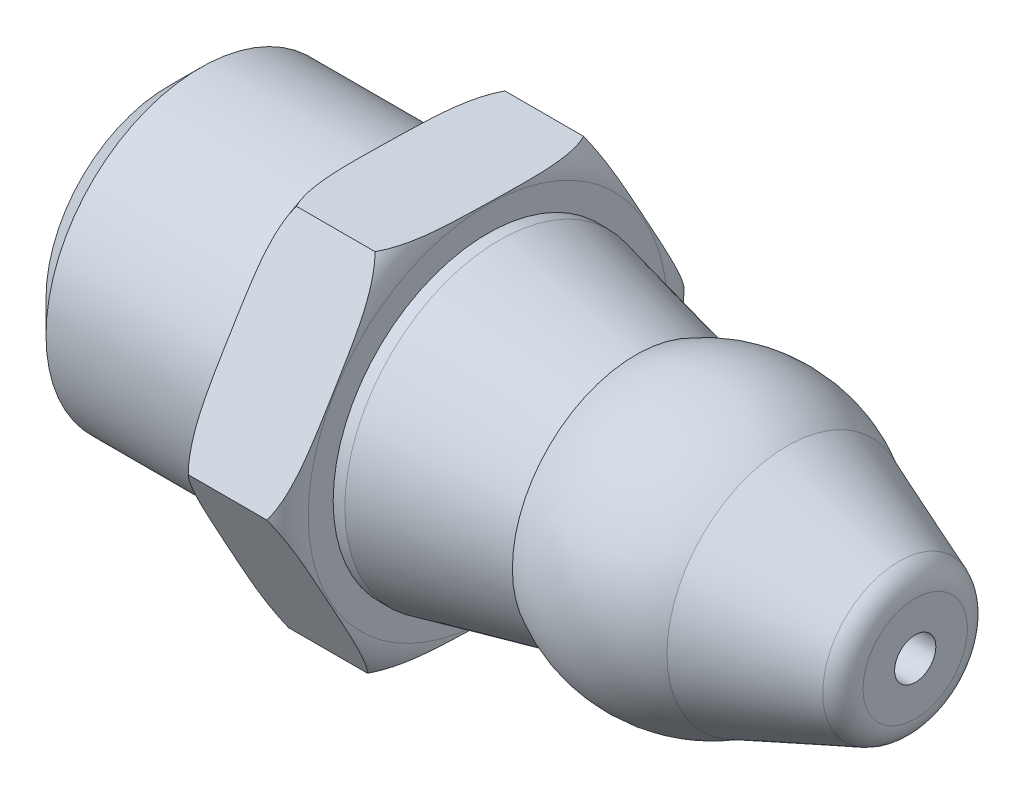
from build123d import *

# Parameters (mm, degrees)
BOSS_EXTRU_1_DEPTH      = 2
ESQUISSE6_R             = 0.4
ENL_V_MAT_EXTRU_1_DEPTH = 16.467514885
CONG_2_R                = 0.5


with BuildPart() as part:
    # Esquisse1 → Base-R_volution (revolve)
    with BuildSketch(Plane.XY, mode=Mode.PRIVATE) as base_r_volution_sk:
        with BuildLine():
            Line((-14.5, 2.375), (-14.5, 0))
            Line((-14.5, 0), (0, 0))
            Line((0, 0), (0, 1.35301988))
            Line((0, 1.35301988), (-2.488313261, 2.331126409))
            ThreePointArc((-2.488313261, 2.331126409), (-3.947593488, 2.755107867), (-5.424258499, 2.396332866))
            Line((-5.424258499, 2.396332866), (-8.073748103, 3))
            Line((-8.073748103, 3), (-13.875, 3))
            Line((-13.875, 3), (-14.5, 2.375))
        make_face()
    revolve(base_r_volution_sk.sketch.rotate(Axis((0, 0, 0), (1, 0, 0)), 90), axis=Axis((0, 0, 0), (1, 0, 0)))

    # Hexagon - inscribed1 → Boss.-Extru.1 (add)
    with BuildSketch(Plane(origin=(-10.3, 0.244712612, 0.463483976), x_dir=(0, 0, 1), z_dir=(-1, 0, 0))):
        Polygon((3.585608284, -0.158969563), (1.486806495, 3.304775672), (-2.562285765, 3.219032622), (-4.512576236, -0.330455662), (-2.413774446, -3.794200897), (1.635317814, -3.708457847), align=None)
    extrude(amount=-BOSS_EXTRU_1_DEPTH)

    # Esquisse5 → Enl_vement de mati_re-R_volution1 (revolve, cut)
    with BuildSketch(Plane(origin=(0, 0, 0), x_dir=(1, 0, 0), z_dir=(0, 1, 0)), mode=Mode.PRIVATE) as enl_vement_de_mati_re_r_volution1_sk:
        with BuildLine():
            Line((-10.3, 4.28259629), (-9.533017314, 4.28259629))
            ThreePointArc((-9.533017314, 4.28259629), (-10.077237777, 4.037201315), (-10.3, 3.483331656))
            Line((-10.3, 3.483331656), (-10.3, 4.28259629))
        make_face()
        with BuildLine():
            Line((-8.3, 3.483331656), (-8.3, 4.28259629))
            Line((-8.3, 4.28259629), (-9.066982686, 4.28259629))
            ThreePointArc((-9.066982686, 4.28259629), (-8.522762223, 4.037201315), (-8.3, 3.483331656))
        make_face()
    revolve(enl_vement_de_mati_re_r_volution1_sk.sketch.rotate(Axis((-15.823303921, 0, 0), (1, 0, 0)), 180), axis=Axis((-15.823303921, 0, 0), (1, 0, 0)), mode=Mode.SUBTRACT)

    # Esquisse6 → Enl_v. mat.-Extru.1 (cut, through all)
    with BuildSketch(Plane(origin=(0, 0, 0), x_dir=(0, 0, -1), z_dir=(1, 0, 0))):
        Circle(ESQUISSE6_R)
    extrude(amount=-ENL_V_MAT_EXTRU_1_DEPTH, mode=Mode.SUBTRACT)

    # Cong_2
    cong_2_edges = [part.edges().sort_by_distance(p)[0] for p in [
        (0, 0, -1.35301988),
    ]]
    fillet(cong_2_edges, radius=CONG_2_R)


solid = part.part
